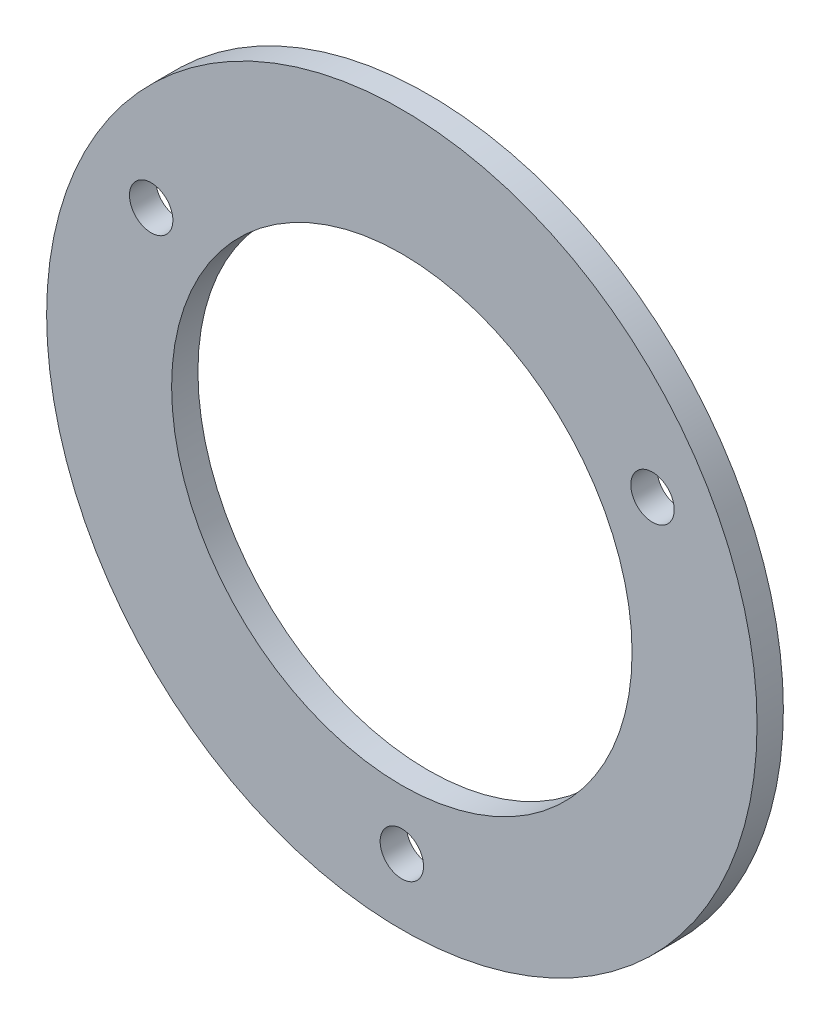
ISO-10303-21;
HEADER;
FILE_DESCRIPTION(('STEP AP214'),'2;1');
FILE_NAME('part.step','',(''),(''),'','','');
FILE_SCHEMA(('AUTOMOTIVE_DESIGN { 1 0 10303 214 1 1 1 1 }'));
ENDSEC;
DATA;
#1=APPLICATION_CONTEXT('core data for automotive mechanical design processes');
#2=APPLICATION_PROTOCOL_DEFINITION('international standard','automotive_design',2000,#1);
#3=PRODUCT_CONTEXT('',#1,'mechanical');
#4=PRODUCT('Part','Part','',(#3));
#5=PRODUCT_RELATED_PRODUCT_CATEGORY('part','',(#4));
#6=PRODUCT_DEFINITION_FORMATION('','',#4);
#7=PRODUCT_DEFINITION_CONTEXT('part definition',#1,'design');
#8=PRODUCT_DEFINITION('design','',#6,#7);
#9=PRODUCT_DEFINITION_SHAPE('','',#8);
#10=(LENGTH_UNIT() NAMED_UNIT(*) SI_UNIT(.MILLI.,.METRE.));
#11=(NAMED_UNIT(*) PLANE_ANGLE_UNIT() SI_UNIT($,.RADIAN.));
#12=(NAMED_UNIT(*) SI_UNIT($,.STERADIAN.) SOLID_ANGLE_UNIT());
#13=UNCERTAINTY_MEASURE_WITH_UNIT(LENGTH_MEASURE(1.E-05),#10,'distance_accuracy_value','');
#14=(GEOMETRIC_REPRESENTATION_CONTEXT(3) GLOBAL_UNCERTAINTY_ASSIGNED_CONTEXT((#13)) GLOBAL_UNIT_ASSIGNED_CONTEXT((#10,
#11,#12)) REPRESENTATION_CONTEXT('',''));
#15=CARTESIAN_POINT('',(0.,0.,0.));
#16=DIRECTION('',(0.,0.,1.));
#17=DIRECTION('',(1.,0.,0.));
#18=AXIS2_PLACEMENT_3D('',#15,#16,#17);
#19=CARTESIAN_POINT('',(25.,92.,2.));
#20=DIRECTION('',(0.,0.,1.));
#21=DIRECTION('',(1.,0.,0.));
#22=AXIS2_PLACEMENT_3D('',#19,#20,#21);
#23=PLANE('',#22);
#24=CARTESIAN_POINT('',(5.94744111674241,103.,2.));
#25=DIRECTION('',(0.,0.,1.));
#26=DIRECTION('',(1.,0.,0.));
#27=AXIS2_PLACEMENT_3D('',#24,#25,#26);
#28=CIRCLE('',#27,1.64999999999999);
#29=CARTESIAN_POINT('',(7.59744111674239,103.,2.));
#30=VERTEX_POINT('',#29);
#31=EDGE_CURVE('E64',#30,#30,#28,.T.);
#32=ORIENTED_EDGE('',*,*,#31,.F.);
#33=EDGE_LOOP('',(#32));
#34=FACE_BOUND('',#33,.T.);
#35=CARTESIAN_POINT('',(25.,70.,2.));
#36=DIRECTION('',(0.,0.,1.));
#37=DIRECTION('',(1.,0.,0.));
#38=AXIS2_PLACEMENT_3D('',#35,#36,#37);
#39=CIRCLE('',#38,1.64999999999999);
#40=CARTESIAN_POINT('',(26.65,70.,2.));
#41=VERTEX_POINT('',#40);
#42=EDGE_CURVE('E58',#41,#41,#39,.T.);
#43=ORIENTED_EDGE('',*,*,#42,.F.);
#44=EDGE_LOOP('',(#43));
#45=FACE_BOUND('',#44,.T.);
#46=CARTESIAN_POINT('',(44.0525588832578,103.,2.));
#47=DIRECTION('',(0.,0.,1.));
#48=DIRECTION('',(1.,0.,0.));
#49=AXIS2_PLACEMENT_3D('',#46,#47,#48);
#50=CIRCLE('',#49,1.64999999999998);
#51=CARTESIAN_POINT('',(45.7025588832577,103.,2.));
#52=VERTEX_POINT('',#51);
#53=EDGE_CURVE('E52',#52,#52,#50,.T.);
#54=ORIENTED_EDGE('',*,*,#53,.F.);
#55=EDGE_LOOP('',(#54));
#56=FACE_BOUND('',#55,.T.);
#57=CARTESIAN_POINT('',(25.,92.,2.));
#58=DIRECTION('',(0.,0.,1.));
#59=DIRECTION('',(1.,0.,0.));
#60=AXIS2_PLACEMENT_3D('',#57,#58,#59);
#61=CIRCLE('',#60,27.);
#62=CARTESIAN_POINT('',(52.,92.,2.));
#63=VERTEX_POINT('',#62);
#64=EDGE_CURVE('E10',#63,#63,#61,.T.);
#65=ORIENTED_EDGE('',*,*,#64,.T.);
#66=EDGE_LOOP('',(#65));
#67=FACE_BOUND('',#66,.T.);
#68=CARTESIAN_POINT('',(25.,92.,2.));
#69=DIRECTION('',(0.,0.,1.));
#70=DIRECTION('',(1.,0.,0.));
#71=AXIS2_PLACEMENT_3D('',#68,#69,#70);
#72=CIRCLE('',#71,17.5);
#73=CARTESIAN_POINT('',(42.5,92.,2.));
#74=VERTEX_POINT('',#73);
#75=EDGE_CURVE('E42',#74,#74,#72,.T.);
#76=ORIENTED_EDGE('',*,*,#75,.F.);
#77=EDGE_LOOP('',(#76));
#78=FACE_BOUND('',#77,.T.);
#79=ADVANCED_FACE('F31',(#34,#45,#56,#67,#78),#23,.T.);
#80=CARTESIAN_POINT('',(25.,92.,0.));
#81=DIRECTION('',(0.,0.,1.));
#82=DIRECTION('',(1.,0.,0.));
#83=AXIS2_PLACEMENT_3D('',#80,#81,#82);
#84=PLANE('',#83);
#85=CARTESIAN_POINT('',(5.94744111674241,103.,0.));
#86=DIRECTION('',(0.,0.,1.));
#87=DIRECTION('',(1.,0.,0.));
#88=AXIS2_PLACEMENT_3D('',#85,#86,#87);
#89=CIRCLE('',#88,1.65);
#90=CARTESIAN_POINT('',(7.5974411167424,103.,0.));
#91=VERTEX_POINT('',#90);
#92=EDGE_CURVE('E61',#91,#91,#89,.T.);
#93=ORIENTED_EDGE('',*,*,#92,.T.);
#94=EDGE_LOOP('',(#93));
#95=FACE_BOUND('',#94,.T.);
#96=CARTESIAN_POINT('',(25.,70.,0.));
#97=DIRECTION('',(0.,0.,1.));
#98=DIRECTION('',(1.,0.,0.));
#99=AXIS2_PLACEMENT_3D('',#96,#97,#98);
#100=CIRCLE('',#99,1.65);
#101=CARTESIAN_POINT('',(26.65,70.,0.));
#102=VERTEX_POINT('',#101);
#103=EDGE_CURVE('E55',#102,#102,#100,.T.);
#104=ORIENTED_EDGE('',*,*,#103,.T.);
#105=EDGE_LOOP('',(#104));
#106=FACE_BOUND('',#105,.T.);
#107=CARTESIAN_POINT('',(44.0525588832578,103.,0.));
#108=DIRECTION('',(0.,0.,1.));
#109=DIRECTION('',(1.,0.,0.));
#110=AXIS2_PLACEMENT_3D('',#107,#108,#109);
#111=CIRCLE('',#110,1.65);
#112=CARTESIAN_POINT('',(45.7025588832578,103.,0.));
#113=VERTEX_POINT('',#112);
#114=EDGE_CURVE('E47',#113,#113,#111,.T.);
#115=ORIENTED_EDGE('',*,*,#114,.T.);
#116=EDGE_LOOP('',(#115));
#117=FACE_BOUND('',#116,.T.);
#118=CARTESIAN_POINT('',(25.,92.,0.));
#119=DIRECTION('',(0.,0.,1.));
#120=DIRECTION('',(1.,0.,0.));
#121=AXIS2_PLACEMENT_3D('',#118,#119,#120);
#122=CIRCLE('',#121,27.);
#123=CARTESIAN_POINT('',(52.,92.,0.));
#124=VERTEX_POINT('',#123);
#125=EDGE_CURVE('E35',#124,#124,#122,.T.);
#126=ORIENTED_EDGE('',*,*,#125,.F.);
#127=EDGE_LOOP('',(#126));
#128=FACE_BOUND('',#127,.T.);
#129=CARTESIAN_POINT('',(25.,92.,0.));
#130=DIRECTION('',(0.,0.,1.));
#131=DIRECTION('',(1.,0.,0.));
#132=AXIS2_PLACEMENT_3D('',#129,#130,#131);
#133=CIRCLE('',#132,17.5);
#134=CARTESIAN_POINT('',(42.5,92.,0.));
#135=VERTEX_POINT('',#134);
#136=EDGE_CURVE('E44',#135,#135,#133,.T.);
#137=ORIENTED_EDGE('',*,*,#136,.T.);
#138=EDGE_LOOP('',(#137));
#139=FACE_BOUND('',#138,.T.);
#140=ADVANCED_FACE('F72',(#95,#106,#117,#128,#139),#84,.F.);
#141=CARTESIAN_POINT('',(25.,92.,2.));
#142=DIRECTION('',(0.,0.,-1.));
#143=DIRECTION('',(-1.,0.,0.));
#144=AXIS2_PLACEMENT_3D('',#141,#142,#143);
#145=CYLINDRICAL_SURFACE('',#144,27.);
#146=ORIENTED_EDGE('',*,*,#64,.F.);
#147=EDGE_LOOP('',(#146));
#148=FACE_BOUND('',#147,.T.);
#149=ORIENTED_EDGE('',*,*,#125,.T.);
#150=EDGE_LOOP('',(#149));
#151=FACE_BOUND('',#150,.T.);
#152=ADVANCED_FACE('F33',(#148,#151),#145,.T.);
#153=CARTESIAN_POINT('',(25.,92.,2.));
#154=DIRECTION('',(0.,0.,-1.));
#155=DIRECTION('',(-1.,0.,0.));
#156=AXIS2_PLACEMENT_3D('',#153,#154,#155);
#157=CYLINDRICAL_SURFACE('',#156,17.5);
#158=ORIENTED_EDGE('',*,*,#75,.T.);
#159=EDGE_LOOP('',(#158));
#160=FACE_BOUND('',#159,.T.);
#161=ORIENTED_EDGE('',*,*,#136,.F.);
#162=EDGE_LOOP('',(#161));
#163=FACE_BOUND('',#162,.T.);
#164=ADVANCED_FACE('F80',(#160,#163),#157,.F.);
#165=CARTESIAN_POINT('',(44.0525588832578,103.,2.));
#166=DIRECTION('',(0.,0.,1.));
#167=DIRECTION('',(1.,0.,0.));
#168=AXIS2_PLACEMENT_3D('',#165,#166,#167);
#169=CYLINDRICAL_SURFACE('',#168,1.64999999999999);
#170=ORIENTED_EDGE('',*,*,#114,.F.);
#171=EDGE_LOOP('',(#170));
#172=FACE_BOUND('',#171,.T.);
#173=ORIENTED_EDGE('',*,*,#53,.T.);
#174=EDGE_LOOP('',(#173));
#175=FACE_BOUND('',#174,.T.);
#176=ADVANCED_FACE('F83',(#172,#175),#169,.F.);
#177=CARTESIAN_POINT('',(25.,70.,2.));
#178=DIRECTION('',(0.,0.,1.));
#179=DIRECTION('',(1.,0.,0.));
#180=AXIS2_PLACEMENT_3D('',#177,#178,#179);
#181=CYLINDRICAL_SURFACE('',#180,1.64999999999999);
#182=ORIENTED_EDGE('',*,*,#103,.F.);
#183=EDGE_LOOP('',(#182));
#184=FACE_BOUND('',#183,.T.);
#185=ORIENTED_EDGE('',*,*,#42,.T.);
#186=EDGE_LOOP('',(#185));
#187=FACE_BOUND('',#186,.T.);
#188=ADVANCED_FACE('F97',(#184,#187),#181,.F.);
#189=CARTESIAN_POINT('',(5.94744111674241,103.,2.));
#190=DIRECTION('',(0.,0.,1.));
#191=DIRECTION('',(1.,0.,0.));
#192=AXIS2_PLACEMENT_3D('',#189,#190,#191);
#193=CYLINDRICAL_SURFACE('',#192,1.64999999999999);
#194=ORIENTED_EDGE('',*,*,#92,.F.);
#195=EDGE_LOOP('',(#194));
#196=FACE_BOUND('',#195,.T.);
#197=ORIENTED_EDGE('',*,*,#31,.T.);
#198=EDGE_LOOP('',(#197));
#199=FACE_BOUND('',#198,.T.);
#200=ADVANCED_FACE('F68',(#196,#199),#193,.F.);
#201=CLOSED_SHELL('',(#79,#140,#152,#164,#176,#188,#200));
#202=MANIFOLD_SOLID_BREP('B2',#201);
#203=ADVANCED_BREP_SHAPE_REPRESENTATION('',(#18,#202),#14);
#204=SHAPE_DEFINITION_REPRESENTATION(#9,#203);
ENDSEC;
END-ISO-10303-21;
